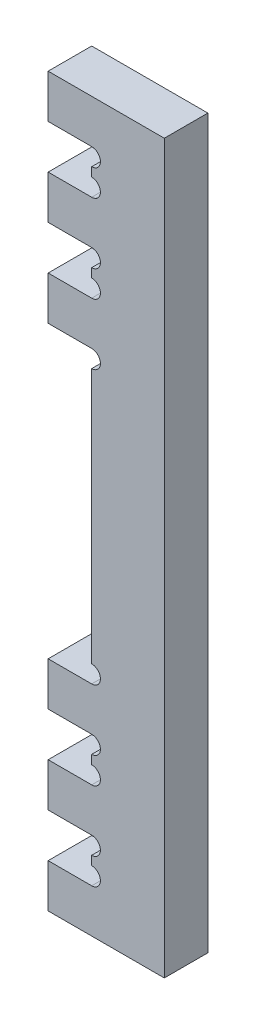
ISO-10303-21;
HEADER;
FILE_DESCRIPTION(('STEP AP214'),'2;1');
FILE_NAME('part.step','',(''),(''),'','','');
FILE_SCHEMA(('AUTOMOTIVE_DESIGN { 1 0 10303 214 1 1 1 1 }'));
ENDSEC;
DATA;
#1=APPLICATION_CONTEXT('core data for automotive mechanical design processes');
#2=APPLICATION_PROTOCOL_DEFINITION('international standard','automotive_design',2000,#1);
#3=PRODUCT_CONTEXT('',#1,'mechanical');
#4=PRODUCT('Part','Part','',(#3));
#5=PRODUCT_RELATED_PRODUCT_CATEGORY('part','',(#4));
#6=PRODUCT_DEFINITION_FORMATION('','',#4);
#7=PRODUCT_DEFINITION_CONTEXT('part definition',#1,'design');
#8=PRODUCT_DEFINITION('design','',#6,#7);
#9=PRODUCT_DEFINITION_SHAPE('','',#8);
#10=(LENGTH_UNIT() NAMED_UNIT(*) SI_UNIT(.MILLI.,.METRE.));
#11=(NAMED_UNIT(*) PLANE_ANGLE_UNIT() SI_UNIT($,.RADIAN.));
#12=(NAMED_UNIT(*) SI_UNIT($,.STERADIAN.) SOLID_ANGLE_UNIT());
#13=UNCERTAINTY_MEASURE_WITH_UNIT(LENGTH_MEASURE(1.E-05),#10,'distance_accuracy_value','');
#14=(GEOMETRIC_REPRESENTATION_CONTEXT(3) GLOBAL_UNCERTAINTY_ASSIGNED_CONTEXT((#13)) GLOBAL_UNIT_ASSIGNED_CONTEXT((#10,
#11,#12)) REPRESENTATION_CONTEXT('',''));
#15=CARTESIAN_POINT('',(0.,0.,0.));
#16=DIRECTION('',(0.,0.,1.));
#17=DIRECTION('',(1.,0.,0.));
#18=AXIS2_PLACEMENT_3D('',#15,#16,#17);
#19=CARTESIAN_POINT('',(15.,172.25,15.));
#20=DIRECTION('',(0.,0.,-1.));
#21=DIRECTION('',(-1.,0.,0.));
#22=AXIS2_PLACEMENT_3D('',#19,#20,#21);
#23=CYLINDRICAL_SURFACE('',#22,3.);
#24=CARTESIAN_POINT('',(15.,172.25,0.));
#25=DIRECTION('',(0.,0.,-1.));
#26=DIRECTION('',(-1.,0.,0.));
#27=AXIS2_PLACEMENT_3D('',#24,#25,#26);
#28=CIRCLE('',#27,3.);
#29=CARTESIAN_POINT('',(15.,175.25,0.));
#30=VERTEX_POINT('',#29);
#31=CARTESIAN_POINT('',(15.,169.25,0.));
#32=VERTEX_POINT('',#31);
#33=EDGE_CURVE('E336',#30,#32,#28,.T.);
#34=ORIENTED_EDGE('',*,*,#33,.T.);
#35=DIRECTION('',(0.,0.,-1.));
#36=VECTOR('',#35,1.);
#37=CARTESIAN_POINT('',(15.,169.25,15.));
#38=LINE('',#37,#36);
#39=CARTESIAN_POINT('',(15.,169.25,15.));
#40=VERTEX_POINT('',#39);
#41=EDGE_CURVE('E11',#40,#32,#38,.T.);
#42=ORIENTED_EDGE('',*,*,#41,.F.);
#43=CARTESIAN_POINT('',(15.,172.25,15.));
#44=DIRECTION('',(0.,0.,-1.));
#45=DIRECTION('',(-1.,0.,0.));
#46=AXIS2_PLACEMENT_3D('',#43,#44,#45);
#47=CIRCLE('',#46,3.);
#48=CARTESIAN_POINT('',(15.,175.25,15.));
#49=VERTEX_POINT('',#48);
#50=EDGE_CURVE('E446',#49,#40,#47,.T.);
#51=ORIENTED_EDGE('',*,*,#50,.F.);
#52=DIRECTION('',(0.,0.,-1.));
#53=VECTOR('',#52,1.);
#54=CARTESIAN_POINT('',(15.,175.25,15.));
#55=LINE('',#54,#53);
#56=EDGE_CURVE('E59',#49,#30,#55,.T.);
#57=ORIENTED_EDGE('',*,*,#56,.T.);
#58=EDGE_LOOP('',(#34,#42,#51,#57));
#59=FACE_BOUND('',#58,.T.);
#60=ADVANCED_FACE('F39',(#59),#23,.F.);
#61=CARTESIAN_POINT('',(15.,169.25,15.));
#62=DIRECTION('',(1.,0.,0.));
#63=DIRECTION('',(0.,1.,0.));
#64=AXIS2_PLACEMENT_3D('',#61,#62,#63);
#65=PLANE('',#64);
#66=DIRECTION('',(0.,-1.,0.));
#67=VECTOR('',#66,1.);
#68=CARTESIAN_POINT('',(15.,169.25,0.));
#69=LINE('',#68,#67);
#70=CARTESIAN_POINT('',(15.,81.2,0.));
#71=VERTEX_POINT('',#70);
#72=EDGE_CURVE('E339',#32,#71,#69,.T.);
#73=ORIENTED_EDGE('',*,*,#72,.T.);
#74=DIRECTION('',(0.,0.,-1.));
#75=VECTOR('',#74,1.);
#76=CARTESIAN_POINT('',(15.,81.2,15.));
#77=LINE('',#76,#75);
#78=CARTESIAN_POINT('',(15.,81.2,15.));
#79=VERTEX_POINT('',#78);
#80=EDGE_CURVE('E48',#79,#71,#77,.T.);
#81=ORIENTED_EDGE('',*,*,#80,.F.);
#82=DIRECTION('',(0.,-1.,0.));
#83=VECTOR('',#82,1.);
#84=CARTESIAN_POINT('',(15.,169.25,15.));
#85=LINE('',#84,#83);
#86=EDGE_CURVE('E195',#40,#79,#85,.T.);
#87=ORIENTED_EDGE('',*,*,#86,.F.);
#88=ORIENTED_EDGE('',*,*,#41,.T.);
#89=EDGE_LOOP('',(#73,#81,#87,#88));
#90=FACE_BOUND('',#89,.T.);
#91=ADVANCED_FACE('F657',(#90),#65,.F.);
#92=CARTESIAN_POINT('',(15.,78.2,15.));
#93=DIRECTION('',(0.,0.,-1.));
#94=DIRECTION('',(-1.,0.,0.));
#95=AXIS2_PLACEMENT_3D('',#92,#93,#94);
#96=CYLINDRICAL_SURFACE('',#95,3.);
#97=CARTESIAN_POINT('',(15.,78.2,0.));
#98=DIRECTION('',(0.,0.,-1.));
#99=DIRECTION('',(-1.,0.,0.));
#100=AXIS2_PLACEMENT_3D('',#97,#98,#99);
#101=CIRCLE('',#100,3.);
#102=CARTESIAN_POINT('',(15.,75.2,0.));
#103=VERTEX_POINT('',#102);
#104=EDGE_CURVE('E342',#71,#103,#101,.T.);
#105=ORIENTED_EDGE('',*,*,#104,.T.);
#106=DIRECTION('',(0.,0.,-1.));
#107=VECTOR('',#106,1.);
#108=CARTESIAN_POINT('',(15.,75.2,15.));
#109=LINE('',#108,#107);
#110=CARTESIAN_POINT('',(15.,75.2,15.));
#111=VERTEX_POINT('',#110);
#112=EDGE_CURVE('E529',#111,#103,#109,.T.);
#113=ORIENTED_EDGE('',*,*,#112,.F.);
#114=CARTESIAN_POINT('',(15.,78.2,15.));
#115=DIRECTION('',(0.,0.,-1.));
#116=DIRECTION('',(-1.,0.,0.));
#117=AXIS2_PLACEMENT_3D('',#114,#115,#116);
#118=CIRCLE('',#117,3.);
#119=EDGE_CURVE('E539',#79,#111,#118,.T.);
#120=ORIENTED_EDGE('',*,*,#119,.F.);
#121=ORIENTED_EDGE('',*,*,#80,.T.);
#122=EDGE_LOOP('',(#105,#113,#120,#121));
#123=FACE_BOUND('',#122,.T.);
#124=ADVANCED_FACE('F537',(#123),#96,.F.);
#125=CARTESIAN_POINT('',(0.,75.2,15.));
#126=DIRECTION('',(0.,1.,0.));
#127=DIRECTION('',(0.,0.,1.));
#128=AXIS2_PLACEMENT_3D('',#125,#126,#127);
#129=PLANE('',#128);
#130=DIRECTION('',(1.,0.,0.));
#131=VECTOR('',#130,1.);
#132=CARTESIAN_POINT('',(0.,75.2,0.));
#133=LINE('',#132,#131);
#134=CARTESIAN_POINT('',(0.,75.2,0.));
#135=VERTEX_POINT('',#134);
#136=EDGE_CURVE('E346',#135,#103,#133,.T.);
#137=ORIENTED_EDGE('',*,*,#136,.F.);
#138=DIRECTION('',(0.,0.,-1.));
#139=VECTOR('',#138,1.);
#140=CARTESIAN_POINT('',(0.,75.2,15.));
#141=LINE('',#140,#139);
#142=CARTESIAN_POINT('',(0.,75.2,15.));
#143=VERTEX_POINT('',#142);
#144=EDGE_CURVE('E526',#143,#135,#141,.T.);
#145=ORIENTED_EDGE('',*,*,#144,.F.);
#146=DIRECTION('',(1.,0.,0.));
#147=VECTOR('',#146,1.);
#148=CARTESIAN_POINT('',(0.,75.2,15.));
#149=LINE('',#148,#147);
#150=EDGE_CURVE('E548',#143,#111,#149,.T.);
#151=ORIENTED_EDGE('',*,*,#150,.T.);
#152=ORIENTED_EDGE('',*,*,#112,.T.);
#153=EDGE_LOOP('',(#137,#145,#151,#152));
#154=FACE_BOUND('',#153,.T.);
#155=ADVANCED_FACE('F545',(#154),#129,.T.);
#156=CARTESIAN_POINT('',(0.,60.2,15.));
#157=DIRECTION('',(-1.,0.,0.));
#158=DIRECTION('',(0.,0.,1.));
#159=AXIS2_PLACEMENT_3D('',#156,#157,#158);
#160=PLANE('',#159);
#161=DIRECTION('',(0.,1.,0.));
#162=VECTOR('',#161,1.);
#163=CARTESIAN_POINT('',(0.,60.2,0.));
#164=LINE('',#163,#162);
#165=CARTESIAN_POINT('',(0.,60.2,0.));
#166=VERTEX_POINT('',#165);
#167=EDGE_CURVE('E350',#166,#135,#164,.T.);
#168=ORIENTED_EDGE('',*,*,#167,.F.);
#169=DIRECTION('',(0.,0.,-1.));
#170=VECTOR('',#169,1.);
#171=CARTESIAN_POINT('',(0.,60.2,15.));
#172=LINE('',#171,#170);
#173=CARTESIAN_POINT('',(0.,60.2,15.));
#174=VERTEX_POINT('',#173);
#175=EDGE_CURVE('E523',#174,#166,#172,.T.);
#176=ORIENTED_EDGE('',*,*,#175,.F.);
#177=DIRECTION('',(0.,1.,0.));
#178=VECTOR('',#177,1.);
#179=CARTESIAN_POINT('',(0.,60.2,15.));
#180=LINE('',#179,#178);
#181=EDGE_CURVE('E552',#174,#143,#180,.T.);
#182=ORIENTED_EDGE('',*,*,#181,.T.);
#183=ORIENTED_EDGE('',*,*,#144,.T.);
#184=EDGE_LOOP('',(#168,#176,#182,#183));
#185=FACE_BOUND('',#184,.T.);
#186=ADVANCED_FACE('F672',(#185),#160,.T.);
#187=CARTESIAN_POINT('',(15.,60.2,15.));
#188=DIRECTION('',(0.,-1.,0.));
#189=DIRECTION('',(1.,0.,0.));
#190=AXIS2_PLACEMENT_3D('',#187,#188,#189);
#191=PLANE('',#190);
#192=DIRECTION('',(-1.,0.,0.));
#193=VECTOR('',#192,1.);
#194=CARTESIAN_POINT('',(15.,60.2,0.));
#195=LINE('',#194,#193);
#196=CARTESIAN_POINT('',(15.,60.2,0.));
#197=VERTEX_POINT('',#196);
#198=EDGE_CURVE('E354',#197,#166,#195,.T.);
#199=ORIENTED_EDGE('',*,*,#198,.F.);
#200=DIRECTION('',(0.,0.,-1.));
#201=VECTOR('',#200,1.);
#202=CARTESIAN_POINT('',(15.,60.2,15.));
#203=LINE('',#202,#201);
#204=CARTESIAN_POINT('',(15.,60.2,15.));
#205=VERTEX_POINT('',#204);
#206=EDGE_CURVE('E521',#205,#197,#203,.T.);
#207=ORIENTED_EDGE('',*,*,#206,.F.);
#208=DIRECTION('',(-1.,0.,0.));
#209=VECTOR('',#208,1.);
#210=CARTESIAN_POINT('',(15.,60.2,15.));
#211=LINE('',#210,#209);
#212=EDGE_CURVE('E555',#205,#174,#211,.T.);
#213=ORIENTED_EDGE('',*,*,#212,.T.);
#214=ORIENTED_EDGE('',*,*,#175,.T.);
#215=EDGE_LOOP('',(#199,#207,#213,#214));
#216=FACE_BOUND('',#215,.T.);
#217=ADVANCED_FACE('F675',(#216),#191,.T.);
#218=CARTESIAN_POINT('',(15.,57.2,15.));
#219=DIRECTION('',(0.,0.,-1.));
#220=DIRECTION('',(-1.,0.,0.));
#221=AXIS2_PLACEMENT_3D('',#218,#219,#220);
#222=CYLINDRICAL_SURFACE('',#221,3.);
#223=CARTESIAN_POINT('',(15.,57.2,0.));
#224=DIRECTION('',(0.,0.,-1.));
#225=DIRECTION('',(-1.,0.,0.));
#226=AXIS2_PLACEMENT_3D('',#223,#224,#225);
#227=CIRCLE('',#226,3.);
#228=CARTESIAN_POINT('',(15.,54.2,0.));
#229=VERTEX_POINT('',#228);
#230=EDGE_CURVE('E357',#197,#229,#227,.T.);
#231=ORIENTED_EDGE('',*,*,#230,.T.);
#232=DIRECTION('',(0.,0.,-1.));
#233=VECTOR('',#232,1.);
#234=CARTESIAN_POINT('',(15.,54.2,15.));
#235=LINE('',#234,#233);
#236=CARTESIAN_POINT('',(15.,54.2,15.));
#237=VERTEX_POINT('',#236);
#238=EDGE_CURVE('E518',#237,#229,#235,.T.);
#239=ORIENTED_EDGE('',*,*,#238,.F.);
#240=CARTESIAN_POINT('',(15.,57.2,15.));
#241=DIRECTION('',(0.,0.,-1.));
#242=DIRECTION('',(-1.,0.,0.));
#243=AXIS2_PLACEMENT_3D('',#240,#241,#242);
#244=CIRCLE('',#243,3.);
#245=EDGE_CURVE('E563',#205,#237,#244,.T.);
#246=ORIENTED_EDGE('',*,*,#245,.F.);
#247=ORIENTED_EDGE('',*,*,#206,.T.);
#248=EDGE_LOOP('',(#231,#239,#246,#247));
#249=FACE_BOUND('',#248,.T.);
#250=ADVANCED_FACE('F679',(#249),#222,.F.);
#251=CARTESIAN_POINT('',(15.,54.2,15.));
#252=DIRECTION('',(1.,0.,0.));
#253=DIRECTION('',(0.,0.,-1.));
#254=AXIS2_PLACEMENT_3D('',#251,#252,#253);
#255=PLANE('',#254);
#256=DIRECTION('',(0.,-1.,0.));
#257=VECTOR('',#256,1.);
#258=CARTESIAN_POINT('',(15.,54.2,0.));
#259=LINE('',#258,#257);
#260=CARTESIAN_POINT('',(15.,51.1,0.));
#261=VERTEX_POINT('',#260);
#262=EDGE_CURVE('E359',#229,#261,#259,.T.);
#263=ORIENTED_EDGE('',*,*,#262,.T.);
#264=DIRECTION('',(0.,0.,-1.));
#265=VECTOR('',#264,1.);
#266=CARTESIAN_POINT('',(15.,51.1,15.));
#267=LINE('',#266,#265);
#268=CARTESIAN_POINT('',(15.,51.1,15.));
#269=VERTEX_POINT('',#268);
#270=EDGE_CURVE('E515',#269,#261,#267,.T.);
#271=ORIENTED_EDGE('',*,*,#270,.F.);
#272=DIRECTION('',(0.,-1.,0.));
#273=VECTOR('',#272,1.);
#274=CARTESIAN_POINT('',(15.,54.2,15.));
#275=LINE('',#274,#273);
#276=EDGE_CURVE('E565',#237,#269,#275,.T.);
#277=ORIENTED_EDGE('',*,*,#276,.F.);
#278=ORIENTED_EDGE('',*,*,#238,.T.);
#279=EDGE_LOOP('',(#263,#271,#277,#278));
#280=FACE_BOUND('',#279,.T.);
#281=ADVANCED_FACE('F683',(#280),#255,.F.);
#282=CARTESIAN_POINT('',(15.,48.1,15.));
#283=DIRECTION('',(0.,0.,-1.));
#284=DIRECTION('',(-1.,0.,0.));
#285=AXIS2_PLACEMENT_3D('',#282,#283,#284);
#286=CYLINDRICAL_SURFACE('',#285,3.);
#287=CARTESIAN_POINT('',(15.,48.1,0.));
#288=DIRECTION('',(0.,0.,-1.));
#289=DIRECTION('',(-1.,0.,0.));
#290=AXIS2_PLACEMENT_3D('',#287,#288,#289);
#291=CIRCLE('',#290,3.);
#292=CARTESIAN_POINT('',(15.,45.1,0.));
#293=VERTEX_POINT('',#292);
#294=EDGE_CURVE('E361',#261,#293,#291,.T.);
#295=ORIENTED_EDGE('',*,*,#294,.T.);
#296=DIRECTION('',(0.,0.,-1.));
#297=VECTOR('',#296,1.);
#298=CARTESIAN_POINT('',(15.,45.1,15.));
#299=LINE('',#298,#297);
#300=CARTESIAN_POINT('',(15.,45.1,15.));
#301=VERTEX_POINT('',#300);
#302=EDGE_CURVE('E513',#301,#293,#299,.T.);
#303=ORIENTED_EDGE('',*,*,#302,.F.);
#304=CARTESIAN_POINT('',(15.,48.1,15.));
#305=DIRECTION('',(0.,0.,-1.));
#306=DIRECTION('',(-1.,0.,0.));
#307=AXIS2_PLACEMENT_3D('',#304,#305,#306);
#308=CIRCLE('',#307,3.);
#309=EDGE_CURVE('E567',#269,#301,#308,.T.);
#310=ORIENTED_EDGE('',*,*,#309,.F.);
#311=ORIENTED_EDGE('',*,*,#270,.T.);
#312=EDGE_LOOP('',(#295,#303,#310,#311));
#313=FACE_BOUND('',#312,.T.);
#314=ADVANCED_FACE('F687',(#313),#286,.F.);
#315=CARTESIAN_POINT('',(0.,45.1,15.));
#316=DIRECTION('',(0.,1.,0.));
#317=DIRECTION('',(-1.,0.,0.));
#318=AXIS2_PLACEMENT_3D('',#315,#316,#317);
#319=PLANE('',#318);
#320=DIRECTION('',(1.,0.,0.));
#321=VECTOR('',#320,1.);
#322=CARTESIAN_POINT('',(0.,45.1,0.));
#323=LINE('',#322,#321);
#324=CARTESIAN_POINT('',(0.,45.1,0.));
#325=VERTEX_POINT('',#324);
#326=EDGE_CURVE('E364',#325,#293,#323,.T.);
#327=ORIENTED_EDGE('',*,*,#326,.F.);
#328=DIRECTION('',(0.,0.,-1.));
#329=VECTOR('',#328,1.);
#330=CARTESIAN_POINT('',(0.,45.1,15.));
#331=LINE('',#330,#329);
#332=CARTESIAN_POINT('',(0.,45.1,15.));
#333=VERTEX_POINT('',#332);
#334=EDGE_CURVE('E511',#333,#325,#331,.T.);
#335=ORIENTED_EDGE('',*,*,#334,.F.);
#336=DIRECTION('',(1.,0.,0.));
#337=VECTOR('',#336,1.);
#338=CARTESIAN_POINT('',(0.,45.1,15.));
#339=LINE('',#338,#337);
#340=EDGE_CURVE('E569',#333,#301,#339,.T.);
#341=ORIENTED_EDGE('',*,*,#340,.T.);
#342=ORIENTED_EDGE('',*,*,#302,.T.);
#343=EDGE_LOOP('',(#327,#335,#341,#342));
#344=FACE_BOUND('',#343,.T.);
#345=ADVANCED_FACE('F691',(#344),#319,.T.);
#346=CARTESIAN_POINT('',(0.,30.1,15.));
#347=DIRECTION('',(-1.,0.,0.));
#348=DIRECTION('',(0.,0.,1.));
#349=AXIS2_PLACEMENT_3D('',#346,#347,#348);
#350=PLANE('',#349);
#351=DIRECTION('',(0.,1.,0.));
#352=VECTOR('',#351,1.);
#353=CARTESIAN_POINT('',(0.,30.1,0.));
#354=LINE('',#353,#352);
#355=CARTESIAN_POINT('',(0.,30.1,0.));
#356=VERTEX_POINT('',#355);
#357=EDGE_CURVE('E367',#356,#325,#354,.T.);
#358=ORIENTED_EDGE('',*,*,#357,.F.);
#359=DIRECTION('',(0.,0.,-1.));
#360=VECTOR('',#359,1.);
#361=CARTESIAN_POINT('',(0.,30.1,15.));
#362=LINE('',#361,#360);
#363=CARTESIAN_POINT('',(0.,30.1,15.));
#364=VERTEX_POINT('',#363);
#365=EDGE_CURVE('E509',#364,#356,#362,.T.);
#366=ORIENTED_EDGE('',*,*,#365,.F.);
#367=DIRECTION('',(0.,1.,0.));
#368=VECTOR('',#367,1.);
#369=CARTESIAN_POINT('',(0.,30.1,15.));
#370=LINE('',#369,#368);
#371=EDGE_CURVE('E572',#364,#333,#370,.T.);
#372=ORIENTED_EDGE('',*,*,#371,.T.);
#373=ORIENTED_EDGE('',*,*,#334,.T.);
#374=EDGE_LOOP('',(#358,#366,#372,#373));
#375=FACE_BOUND('',#374,.T.);
#376=ADVANCED_FACE('F695',(#375),#350,.T.);
#377=CARTESIAN_POINT('',(15.,30.1,15.));
#378=DIRECTION('',(0.,-1.,0.));
#379=DIRECTION('',(1.,0.,0.));
#380=AXIS2_PLACEMENT_3D('',#377,#378,#379);
#381=PLANE('',#380);
#382=DIRECTION('',(-1.,0.,0.));
#383=VECTOR('',#382,1.);
#384=CARTESIAN_POINT('',(15.,30.1,0.));
#385=LINE('',#384,#383);
#386=CARTESIAN_POINT('',(15.,30.1,0.));
#387=VERTEX_POINT('',#386);
#388=EDGE_CURVE('E370',#387,#356,#385,.T.);
#389=ORIENTED_EDGE('',*,*,#388,.F.);
#390=DIRECTION('',(0.,0.,-1.));
#391=VECTOR('',#390,1.);
#392=CARTESIAN_POINT('',(15.,30.1,15.));
#393=LINE('',#392,#391);
#394=CARTESIAN_POINT('',(15.,30.1,15.));
#395=VERTEX_POINT('',#394);
#396=EDGE_CURVE('E507',#395,#387,#393,.T.);
#397=ORIENTED_EDGE('',*,*,#396,.F.);
#398=DIRECTION('',(-1.,0.,0.));
#399=VECTOR('',#398,1.);
#400=CARTESIAN_POINT('',(15.,30.1,15.));
#401=LINE('',#400,#399);
#402=EDGE_CURVE('E575',#395,#364,#401,.T.);
#403=ORIENTED_EDGE('',*,*,#402,.T.);
#404=ORIENTED_EDGE('',*,*,#365,.T.);
#405=EDGE_LOOP('',(#389,#397,#403,#404));
#406=FACE_BOUND('',#405,.T.);
#407=ADVANCED_FACE('F699',(#406),#381,.T.);
#408=CARTESIAN_POINT('',(15.,27.1,15.));
#409=DIRECTION('',(0.,0.,-1.));
#410=DIRECTION('',(-1.,0.,0.));
#411=AXIS2_PLACEMENT_3D('',#408,#409,#410);
#412=CYLINDRICAL_SURFACE('',#411,3.00000000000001);
#413=CARTESIAN_POINT('',(15.,27.1,0.));
#414=DIRECTION('',(0.,0.,-1.));
#415=DIRECTION('',(-1.,0.,0.));
#416=AXIS2_PLACEMENT_3D('',#413,#414,#415);
#417=CIRCLE('',#416,3.00000000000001);
#418=CARTESIAN_POINT('',(15.,24.1,0.));
#419=VERTEX_POINT('',#418);
#420=EDGE_CURVE('E373',#387,#419,#417,.T.);
#421=ORIENTED_EDGE('',*,*,#420,.T.);
#422=DIRECTION('',(0.,0.,-1.));
#423=VECTOR('',#422,1.);
#424=CARTESIAN_POINT('',(15.,24.1,15.));
#425=LINE('',#424,#423);
#426=CARTESIAN_POINT('',(15.,24.1,15.));
#427=VERTEX_POINT('',#426);
#428=EDGE_CURVE('E504',#427,#419,#425,.T.);
#429=ORIENTED_EDGE('',*,*,#428,.F.);
#430=CARTESIAN_POINT('',(15.,27.1,15.));
#431=DIRECTION('',(0.,0.,-1.));
#432=DIRECTION('',(-1.,0.,0.));
#433=AXIS2_PLACEMENT_3D('',#430,#431,#432);
#434=CIRCLE('',#433,3.00000000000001);
#435=EDGE_CURVE('E578',#395,#427,#434,.T.);
#436=ORIENTED_EDGE('',*,*,#435,.F.);
#437=ORIENTED_EDGE('',*,*,#396,.T.);
#438=EDGE_LOOP('',(#421,#429,#436,#437));
#439=FACE_BOUND('',#438,.T.);
#440=ADVANCED_FACE('F703',(#439),#412,.F.);
#441=CARTESIAN_POINT('',(15.,24.1,15.));
#442=DIRECTION('',(1.,0.,0.));
#443=DIRECTION('',(0.,1.,0.));
#444=AXIS2_PLACEMENT_3D('',#441,#442,#443);
#445=PLANE('',#444);
#446=DIRECTION('',(0.,-1.,0.));
#447=VECTOR('',#446,1.);
#448=CARTESIAN_POINT('',(15.,24.1,0.));
#449=LINE('',#448,#447);
#450=CARTESIAN_POINT('',(15.,21.,0.));
#451=VERTEX_POINT('',#450);
#452=EDGE_CURVE('E375',#419,#451,#449,.T.);
#453=ORIENTED_EDGE('',*,*,#452,.T.);
#454=DIRECTION('',(0.,0.,-1.));
#455=VECTOR('',#454,1.);
#456=CARTESIAN_POINT('',(15.,21.,15.));
#457=LINE('',#456,#455);
#458=CARTESIAN_POINT('',(15.,21.,15.));
#459=VERTEX_POINT('',#458);
#460=EDGE_CURVE('E501',#459,#451,#457,.T.);
#461=ORIENTED_EDGE('',*,*,#460,.F.);
#462=DIRECTION('',(0.,-1.,0.));
#463=VECTOR('',#462,1.);
#464=CARTESIAN_POINT('',(15.,24.1,15.));
#465=LINE('',#464,#463);
#466=EDGE_CURVE('E580',#427,#459,#465,.T.);
#467=ORIENTED_EDGE('',*,*,#466,.F.);
#468=ORIENTED_EDGE('',*,*,#428,.T.);
#469=EDGE_LOOP('',(#453,#461,#467,#468));
#470=FACE_BOUND('',#469,.T.);
#471=ADVANCED_FACE('F707',(#470),#445,.F.);
#472=CARTESIAN_POINT('',(15.,18.,15.));
#473=DIRECTION('',(0.,0.,-1.));
#474=DIRECTION('',(-1.,0.,0.));
#475=AXIS2_PLACEMENT_3D('',#472,#473,#474);
#476=CYLINDRICAL_SURFACE('',#475,2.99999999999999);
#477=CARTESIAN_POINT('',(15.,18.,0.));
#478=DIRECTION('',(0.,0.,-1.));
#479=DIRECTION('',(-1.,0.,0.));
#480=AXIS2_PLACEMENT_3D('',#477,#478,#479);
#481=CIRCLE('',#480,2.99999999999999);
#482=CARTESIAN_POINT('',(15.,15.,0.));
#483=VERTEX_POINT('',#482);
#484=EDGE_CURVE('E377',#451,#483,#481,.T.);
#485=ORIENTED_EDGE('',*,*,#484,.T.);
#486=DIRECTION('',(0.,0.,-1.));
#487=VECTOR('',#486,1.);
#488=CARTESIAN_POINT('',(15.,15.,15.));
#489=LINE('',#488,#487);
#490=CARTESIAN_POINT('',(15.,15.,15.));
#491=VERTEX_POINT('',#490);
#492=EDGE_CURVE('E499',#491,#483,#489,.T.);
#493=ORIENTED_EDGE('',*,*,#492,.F.);
#494=CARTESIAN_POINT('',(15.,18.,15.));
#495=DIRECTION('',(0.,0.,-1.));
#496=DIRECTION('',(-1.,0.,0.));
#497=AXIS2_PLACEMENT_3D('',#494,#495,#496);
#498=CIRCLE('',#497,2.99999999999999);
#499=EDGE_CURVE('E582',#459,#491,#498,.T.);
#500=ORIENTED_EDGE('',*,*,#499,.F.);
#501=ORIENTED_EDGE('',*,*,#460,.T.);
#502=EDGE_LOOP('',(#485,#493,#500,#501));
#503=FACE_BOUND('',#502,.T.);
#504=ADVANCED_FACE('F711',(#503),#476,.F.);
#505=CARTESIAN_POINT('',(0.,15.,15.));
#506=DIRECTION('',(0.,1.,0.));
#507=DIRECTION('',(-1.,0.,0.));
#508=AXIS2_PLACEMENT_3D('',#505,#506,#507);
#509=PLANE('',#508);
#510=DIRECTION('',(1.,0.,0.));
#511=VECTOR('',#510,1.);
#512=CARTESIAN_POINT('',(0.,15.,0.));
#513=LINE('',#512,#511);
#514=CARTESIAN_POINT('',(0.,15.,0.));
#515=VERTEX_POINT('',#514);
#516=EDGE_CURVE('E380',#515,#483,#513,.T.);
#517=ORIENTED_EDGE('',*,*,#516,.F.);
#518=DIRECTION('',(0.,0.,-1.));
#519=VECTOR('',#518,1.);
#520=CARTESIAN_POINT('',(0.,15.,15.));
#521=LINE('',#520,#519);
#522=CARTESIAN_POINT('',(0.,15.,15.));
#523=VERTEX_POINT('',#522);
#524=EDGE_CURVE('E497',#523,#515,#521,.T.);
#525=ORIENTED_EDGE('',*,*,#524,.F.);
#526=DIRECTION('',(1.,0.,0.));
#527=VECTOR('',#526,1.);
#528=CARTESIAN_POINT('',(0.,15.,15.));
#529=LINE('',#528,#527);
#530=EDGE_CURVE('E584',#523,#491,#529,.T.);
#531=ORIENTED_EDGE('',*,*,#530,.T.);
#532=ORIENTED_EDGE('',*,*,#492,.T.);
#533=EDGE_LOOP('',(#517,#525,#531,#532));
#534=FACE_BOUND('',#533,.T.);
#535=ADVANCED_FACE('F715',(#534),#509,.T.);
#536=CARTESIAN_POINT('',(0.,0.,15.));
#537=DIRECTION('',(-1.,0.,0.));
#538=DIRECTION('',(0.,0.,1.));
#539=AXIS2_PLACEMENT_3D('',#536,#537,#538);
#540=PLANE('',#539);
#541=DIRECTION('',(0.,1.,0.));
#542=VECTOR('',#541,1.);
#543=CARTESIAN_POINT('',(0.,0.,0.));
#544=LINE('',#543,#542);
#545=CARTESIAN_POINT('',(0.,0.,0.));
#546=VERTEX_POINT('',#545);
#547=EDGE_CURVE('E383',#546,#515,#544,.T.);
#548=ORIENTED_EDGE('',*,*,#547,.F.);
#549=DIRECTION('',(0.,0.,-1.));
#550=VECTOR('',#549,1.);
#551=CARTESIAN_POINT('',(0.,0.,15.));
#552=LINE('',#551,#550);
#553=CARTESIAN_POINT('',(0.,0.,15.));
#554=VERTEX_POINT('',#553);
#555=EDGE_CURVE('E495',#554,#546,#552,.T.);
#556=ORIENTED_EDGE('',*,*,#555,.F.);
#557=DIRECTION('',(0.,1.,0.));
#558=VECTOR('',#557,1.);
#559=CARTESIAN_POINT('',(0.,0.,15.));
#560=LINE('',#559,#558);
#561=EDGE_CURVE('E587',#554,#523,#560,.T.);
#562=ORIENTED_EDGE('',*,*,#561,.T.);
#563=ORIENTED_EDGE('',*,*,#524,.T.);
#564=EDGE_LOOP('',(#548,#556,#562,#563));
#565=FACE_BOUND('',#564,.T.);
#566=ADVANCED_FACE('F719',(#565),#540,.T.);
#567=CARTESIAN_POINT('',(0.,0.,15.));
#568=DIRECTION('',(0.,1.,0.));
#569=DIRECTION('',(0.,0.,1.));
#570=AXIS2_PLACEMENT_3D('',#567,#568,#569);
#571=PLANE('',#570);
#572=DIRECTION('',(1.,0.,0.));
#573=VECTOR('',#572,1.);
#574=CARTESIAN_POINT('',(0.,0.,0.));
#575=LINE('',#574,#573);
#576=CARTESIAN_POINT('',(40.,0.,0.));
#577=VERTEX_POINT('',#576);
#578=EDGE_CURVE('E386',#546,#577,#575,.T.);
#579=ORIENTED_EDGE('',*,*,#578,.T.);
#580=DIRECTION('',(0.,0.,-1.));
#581=VECTOR('',#580,1.);
#582=CARTESIAN_POINT('',(40.,0.,15.));
#583=LINE('',#582,#581);
#584=CARTESIAN_POINT('',(40.,0.,15.));
#585=VERTEX_POINT('',#584);
#586=EDGE_CURVE('E493',#585,#577,#583,.T.);
#587=ORIENTED_EDGE('',*,*,#586,.F.);
#588=DIRECTION('',(1.,0.,0.));
#589=VECTOR('',#588,1.);
#590=CARTESIAN_POINT('',(0.,0.,15.));
#591=LINE('',#590,#589);
#592=EDGE_CURVE('E590',#554,#585,#591,.T.);
#593=ORIENTED_EDGE('',*,*,#592,.F.);
#594=ORIENTED_EDGE('',*,*,#555,.T.);
#595=EDGE_LOOP('',(#579,#587,#593,#594));
#596=FACE_BOUND('',#595,.T.);
#597=ADVANCED_FACE('F723',(#596),#571,.F.);
#598=CARTESIAN_POINT('',(40.,250.45,15.));
#599=DIRECTION('',(1.,0.,0.));
#600=DIRECTION('',(0.,1.,0.));
#601=AXIS2_PLACEMENT_3D('',#598,#599,#600);
#602=PLANE('',#601);
#603=DIRECTION('',(0.,-1.,0.));
#604=VECTOR('',#603,1.);
#605=CARTESIAN_POINT('',(40.,250.45,0.));
#606=LINE('',#605,#604);
#607=CARTESIAN_POINT('',(40.,250.45,0.));
#608=VERTEX_POINT('',#607);
#609=EDGE_CURVE('E389',#608,#577,#606,.T.);
#610=ORIENTED_EDGE('',*,*,#609,.F.);
#611=DIRECTION('',(0.,0.,-1.));
#612=VECTOR('',#611,1.);
#613=CARTESIAN_POINT('',(40.,250.45,15.));
#614=LINE('',#613,#612);
#615=CARTESIAN_POINT('',(40.,250.45,15.));
#616=VERTEX_POINT('',#615);
#617=EDGE_CURVE('E490',#616,#608,#614,.T.);
#618=ORIENTED_EDGE('',*,*,#617,.F.);
#619=DIRECTION('',(0.,-1.,0.));
#620=VECTOR('',#619,1.);
#621=CARTESIAN_POINT('',(40.,250.45,15.));
#622=LINE('',#621,#620);
#623=EDGE_CURVE('E592',#616,#585,#622,.T.);
#624=ORIENTED_EDGE('',*,*,#623,.T.);
#625=ORIENTED_EDGE('',*,*,#586,.T.);
#626=EDGE_LOOP('',(#610,#618,#624,#625));
#627=FACE_BOUND('',#626,.T.);
#628=ADVANCED_FACE('F727',(#627),#602,.T.);
#629=CARTESIAN_POINT('',(0.,250.45,15.));
#630=DIRECTION('',(0.,1.,0.));
#631=DIRECTION('',(0.,0.,1.));
#632=AXIS2_PLACEMENT_3D('',#629,#630,#631);
#633=PLANE('',#632);
#634=DIRECTION('',(1.,0.,0.));
#635=VECTOR('',#634,1.);
#636=CARTESIAN_POINT('',(0.,250.45,0.));
#637=LINE('',#636,#635);
#638=CARTESIAN_POINT('',(0.,250.45,0.));
#639=VERTEX_POINT('',#638);
#640=EDGE_CURVE('E393',#639,#608,#637,.T.);
#641=ORIENTED_EDGE('',*,*,#640,.F.);
#642=DIRECTION('',(0.,0.,-1.));
#643=VECTOR('',#642,1.);
#644=CARTESIAN_POINT('',(0.,250.45,15.));
#645=LINE('',#644,#643);
#646=CARTESIAN_POINT('',(0.,250.45,15.));
#647=VERTEX_POINT('',#646);
#648=EDGE_CURVE('E487',#647,#639,#645,.T.);
#649=ORIENTED_EDGE('',*,*,#648,.F.);
#650=DIRECTION('',(1.,0.,0.));
#651=VECTOR('',#650,1.);
#652=CARTESIAN_POINT('',(0.,250.45,15.));
#653=LINE('',#652,#651);
#654=EDGE_CURVE('E596',#647,#616,#653,.T.);
#655=ORIENTED_EDGE('',*,*,#654,.T.);
#656=ORIENTED_EDGE('',*,*,#617,.T.);
#657=EDGE_LOOP('',(#641,#649,#655,#656));
#658=FACE_BOUND('',#657,.T.);
#659=ADVANCED_FACE('F731',(#658),#633,.T.);
#660=CARTESIAN_POINT('',(0.,235.45,15.));
#661=DIRECTION('',(-1.,0.,0.));
#662=DIRECTION('',(0.,0.,1.));
#663=AXIS2_PLACEMENT_3D('',#660,#661,#662);
#664=PLANE('',#663);
#665=DIRECTION('',(0.,1.,0.));
#666=VECTOR('',#665,1.);
#667=CARTESIAN_POINT('',(0.,235.45,0.));
#668=LINE('',#667,#666);
#669=CARTESIAN_POINT('',(0.,235.45,0.));
#670=VERTEX_POINT('',#669);
#671=EDGE_CURVE('E397',#670,#639,#668,.T.);
#672=ORIENTED_EDGE('',*,*,#671,.F.);
#673=DIRECTION('',(0.,0.,-1.));
#674=VECTOR('',#673,1.);
#675=CARTESIAN_POINT('',(0.,235.45,15.));
#676=LINE('',#675,#674);
#677=CARTESIAN_POINT('',(0.,235.45,15.));
#678=VERTEX_POINT('',#677);
#679=EDGE_CURVE('E484',#678,#670,#676,.T.);
#680=ORIENTED_EDGE('',*,*,#679,.F.);
#681=DIRECTION('',(0.,1.,0.));
#682=VECTOR('',#681,1.);
#683=CARTESIAN_POINT('',(0.,235.45,15.));
#684=LINE('',#683,#682);
#685=EDGE_CURVE('E600',#678,#647,#684,.T.);
#686=ORIENTED_EDGE('',*,*,#685,.T.);
#687=ORIENTED_EDGE('',*,*,#648,.T.);
#688=EDGE_LOOP('',(#672,#680,#686,#687));
#689=FACE_BOUND('',#688,.T.);
#690=ADVANCED_FACE('F735',(#689),#664,.T.);
#691=CARTESIAN_POINT('',(15.,235.45,15.));
#692=DIRECTION('',(0.,-1.,0.));
#693=DIRECTION('',(0.,0.,-1.));
#694=AXIS2_PLACEMENT_3D('',#691,#692,#693);
#695=PLANE('',#694);
#696=DIRECTION('',(-1.,0.,0.));
#697=VECTOR('',#696,1.);
#698=CARTESIAN_POINT('',(15.,235.45,0.));
#699=LINE('',#698,#697);
#700=CARTESIAN_POINT('',(15.,235.45,0.));
#701=VERTEX_POINT('',#700);
#702=EDGE_CURVE('E401',#701,#670,#699,.T.);
#703=ORIENTED_EDGE('',*,*,#702,.F.);
#704=DIRECTION('',(0.,0.,-1.));
#705=VECTOR('',#704,1.);
#706=CARTESIAN_POINT('',(15.,235.45,15.));
#707=LINE('',#706,#705);
#708=CARTESIAN_POINT('',(15.,235.45,15.));
#709=VERTEX_POINT('',#708);
#710=EDGE_CURVE('E481',#709,#701,#707,.T.);
#711=ORIENTED_EDGE('',*,*,#710,.F.);
#712=DIRECTION('',(-1.,0.,0.));
#713=VECTOR('',#712,1.);
#714=CARTESIAN_POINT('',(15.,235.45,15.));
#715=LINE('',#714,#713);
#716=EDGE_CURVE('E604',#709,#678,#715,.T.);
#717=ORIENTED_EDGE('',*,*,#716,.T.);
#718=ORIENTED_EDGE('',*,*,#679,.T.);
#719=EDGE_LOOP('',(#703,#711,#717,#718));
#720=FACE_BOUND('',#719,.T.);
#721=ADVANCED_FACE('F739',(#720),#695,.T.);
#722=CARTESIAN_POINT('',(15.,232.45,15.));
#723=DIRECTION('',(0.,0.,-1.));
#724=DIRECTION('',(-1.,0.,0.));
#725=AXIS2_PLACEMENT_3D('',#722,#723,#724);
#726=CYLINDRICAL_SURFACE('',#725,3.);
#727=CARTESIAN_POINT('',(15.,232.45,0.));
#728=DIRECTION('',(0.,0.,-1.));
#729=DIRECTION('',(-1.,0.,0.));
#730=AXIS2_PLACEMENT_3D('',#727,#728,#729);
#731=CIRCLE('',#730,3.);
#732=CARTESIAN_POINT('',(15.,229.45,0.));
#733=VERTEX_POINT('',#732);
#734=EDGE_CURVE('E405',#701,#733,#731,.T.);
#735=ORIENTED_EDGE('',*,*,#734,.T.);
#736=DIRECTION('',(0.,0.,-1.));
#737=VECTOR('',#736,1.);
#738=CARTESIAN_POINT('',(15.,229.45,15.));
#739=LINE('',#738,#737);
#740=CARTESIAN_POINT('',(15.,229.45,15.));
#741=VERTEX_POINT('',#740);
#742=EDGE_CURVE('E477',#741,#733,#739,.T.);
#743=ORIENTED_EDGE('',*,*,#742,.F.);
#744=CARTESIAN_POINT('',(15.,232.45,15.));
#745=DIRECTION('',(0.,0.,-1.));
#746=DIRECTION('',(-1.,0.,0.));
#747=AXIS2_PLACEMENT_3D('',#744,#745,#746);
#748=CIRCLE('',#747,3.);
#749=EDGE_CURVE('E608',#709,#741,#748,.T.);
#750=ORIENTED_EDGE('',*,*,#749,.F.);
#751=ORIENTED_EDGE('',*,*,#710,.T.);
#752=EDGE_LOOP('',(#735,#743,#750,#751));
#753=FACE_BOUND('',#752,.T.);
#754=ADVANCED_FACE('F743',(#753),#726,.F.);
#755=CARTESIAN_POINT('',(15.,229.45,15.));
#756=DIRECTION('',(1.,0.,0.));
#757=DIRECTION('',(0.,0.,-1.));
#758=AXIS2_PLACEMENT_3D('',#755,#756,#757);
#759=PLANE('',#758);
#760=DIRECTION('',(0.,-1.,0.));
#761=VECTOR('',#760,1.);
#762=CARTESIAN_POINT('',(15.,229.45,0.));
#763=LINE('',#762,#761);
#764=CARTESIAN_POINT('',(15.,226.35,0.));
#765=VERTEX_POINT('',#764);
#766=EDGE_CURVE('E408',#733,#765,#763,.T.);
#767=ORIENTED_EDGE('',*,*,#766,.T.);
#768=DIRECTION('',(0.,0.,-1.));
#769=VECTOR('',#768,1.);
#770=CARTESIAN_POINT('',(15.,226.35,15.));
#771=LINE('',#770,#769);
#772=CARTESIAN_POINT('',(15.,226.35,15.));
#773=VERTEX_POINT('',#772);
#774=EDGE_CURVE('E473',#773,#765,#771,.T.);
#775=ORIENTED_EDGE('',*,*,#774,.F.);
#776=DIRECTION('',(0.,-1.,0.));
#777=VECTOR('',#776,1.);
#778=CARTESIAN_POINT('',(15.,229.45,15.));
#779=LINE('',#778,#777);
#780=EDGE_CURVE('E611',#741,#773,#779,.T.);
#781=ORIENTED_EDGE('',*,*,#780,.F.);
#782=ORIENTED_EDGE('',*,*,#742,.T.);
#783=EDGE_LOOP('',(#767,#775,#781,#782));
#784=FACE_BOUND('',#783,.T.);
#785=ADVANCED_FACE('F747',(#784),#759,.F.);
#786=CARTESIAN_POINT('',(15.0000000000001,223.35,15.));
#787=DIRECTION('',(0.,0.,-1.));
#788=DIRECTION('',(-1.,0.,0.));
#789=AXIS2_PLACEMENT_3D('',#786,#787,#788);
#790=CYLINDRICAL_SURFACE('',#789,3.);
#791=CARTESIAN_POINT('',(15.0000000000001,223.35,0.));
#792=DIRECTION('',(0.,0.,-1.));
#793=DIRECTION('',(-1.,0.,0.));
#794=AXIS2_PLACEMENT_3D('',#791,#792,#793);
#795=CIRCLE('',#794,3.);
#796=CARTESIAN_POINT('',(15.,220.35,0.));
#797=VERTEX_POINT('',#796);
#798=EDGE_CURVE('E411',#765,#797,#795,.T.);
#799=ORIENTED_EDGE('',*,*,#798,.T.);
#800=DIRECTION('',(0.,0.,-1.));
#801=VECTOR('',#800,1.);
#802=CARTESIAN_POINT('',(15.,220.35,15.));
#803=LINE('',#802,#801);
#804=CARTESIAN_POINT('',(15.,220.35,15.));
#805=VERTEX_POINT('',#804);
#806=EDGE_CURVE('E470',#805,#797,#803,.T.);
#807=ORIENTED_EDGE('',*,*,#806,.F.);
#808=CARTESIAN_POINT('',(15.0000000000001,223.35,15.));
#809=DIRECTION('',(0.,0.,-1.));
#810=DIRECTION('',(-1.,0.,0.));
#811=AXIS2_PLACEMENT_3D('',#808,#809,#810);
#812=CIRCLE('',#811,3.);
#813=EDGE_CURVE('E614',#773,#805,#812,.T.);
#814=ORIENTED_EDGE('',*,*,#813,.F.);
#815=ORIENTED_EDGE('',*,*,#774,.T.);
#816=EDGE_LOOP('',(#799,#807,#814,#815));
#817=FACE_BOUND('',#816,.T.);
#818=ADVANCED_FACE('F751',(#817),#790,.F.);
#819=CARTESIAN_POINT('',(0.,220.35,15.));
#820=DIRECTION('',(0.,1.,0.));
#821=DIRECTION('',(0.,0.,1.));
#822=AXIS2_PLACEMENT_3D('',#819,#820,#821);
#823=PLANE('',#822);
#824=DIRECTION('',(1.,0.,0.));
#825=VECTOR('',#824,1.);
#826=CARTESIAN_POINT('',(0.,220.35,0.));
#827=LINE('',#826,#825);
#828=CARTESIAN_POINT('',(0.,220.35,0.));
#829=VERTEX_POINT('',#828);
#830=EDGE_CURVE('E415',#829,#797,#827,.T.);
#831=ORIENTED_EDGE('',*,*,#830,.F.);
#832=DIRECTION('',(0.,0.,-1.));
#833=VECTOR('',#832,1.);
#834=CARTESIAN_POINT('',(0.,220.35,15.));
#835=LINE('',#834,#833);
#836=CARTESIAN_POINT('',(0.,220.35,15.));
#837=VERTEX_POINT('',#836);
#838=EDGE_CURVE('E467',#837,#829,#835,.T.);
#839=ORIENTED_EDGE('',*,*,#838,.F.);
#840=DIRECTION('',(1.,0.,0.));
#841=VECTOR('',#840,1.);
#842=CARTESIAN_POINT('',(0.,220.35,15.));
#843=LINE('',#842,#841);
#844=EDGE_CURVE('E617',#837,#805,#843,.T.);
#845=ORIENTED_EDGE('',*,*,#844,.T.);
#846=ORIENTED_EDGE('',*,*,#806,.T.);
#847=EDGE_LOOP('',(#831,#839,#845,#846));
#848=FACE_BOUND('',#847,.T.);
#849=ADVANCED_FACE('F755',(#848),#823,.T.);
#850=CARTESIAN_POINT('',(0.,205.35,15.));
#851=DIRECTION('',(-1.,0.,0.));
#852=DIRECTION('',(0.,0.,1.));
#853=AXIS2_PLACEMENT_3D('',#850,#851,#852);
#854=PLANE('',#853);
#855=DIRECTION('',(0.,1.,0.));
#856=VECTOR('',#855,1.);
#857=CARTESIAN_POINT('',(0.,205.35,0.));
#858=LINE('',#857,#856);
#859=CARTESIAN_POINT('',(0.,205.35,0.));
#860=VERTEX_POINT('',#859);
#861=EDGE_CURVE('E419',#860,#829,#858,.T.);
#862=ORIENTED_EDGE('',*,*,#861,.F.);
#863=DIRECTION('',(0.,0.,-1.));
#864=VECTOR('',#863,1.);
#865=CARTESIAN_POINT('',(0.,205.35,15.));
#866=LINE('',#865,#864);
#867=CARTESIAN_POINT('',(0.,205.35,15.));
#868=VERTEX_POINT('',#867);
#869=EDGE_CURVE('E464',#868,#860,#866,.T.);
#870=ORIENTED_EDGE('',*,*,#869,.F.);
#871=DIRECTION('',(0.,1.,0.));
#872=VECTOR('',#871,1.);
#873=CARTESIAN_POINT('',(0.,205.35,15.));
#874=LINE('',#873,#872);
#875=EDGE_CURVE('E621',#868,#837,#874,.T.);
#876=ORIENTED_EDGE('',*,*,#875,.T.);
#877=ORIENTED_EDGE('',*,*,#838,.T.);
#878=EDGE_LOOP('',(#862,#870,#876,#877));
#879=FACE_BOUND('',#878,.T.);
#880=ADVANCED_FACE('F759',(#879),#854,.T.);
#881=CARTESIAN_POINT('',(15.,205.35,15.));
#882=DIRECTION('',(0.,-1.,0.));
#883=DIRECTION('',(0.,0.,-1.));
#884=AXIS2_PLACEMENT_3D('',#881,#882,#883);
#885=PLANE('',#884);
#886=DIRECTION('',(-1.,0.,0.));
#887=VECTOR('',#886,1.);
#888=CARTESIAN_POINT('',(15.,205.35,0.));
#889=LINE('',#888,#887);
#890=CARTESIAN_POINT('',(15.,205.35,0.));
#891=VERTEX_POINT('',#890);
#892=EDGE_CURVE('E423',#891,#860,#889,.T.);
#893=ORIENTED_EDGE('',*,*,#892,.F.);
#894=DIRECTION('',(0.,0.,-1.));
#895=VECTOR('',#894,1.);
#896=CARTESIAN_POINT('',(15.,205.35,15.));
#897=LINE('',#896,#895);
#898=CARTESIAN_POINT('',(15.,205.35,15.));
#899=VERTEX_POINT('',#898);
#900=EDGE_CURVE('E461',#899,#891,#897,.T.);
#901=ORIENTED_EDGE('',*,*,#900,.F.);
#902=DIRECTION('',(-1.,0.,0.));
#903=VECTOR('',#902,1.);
#904=CARTESIAN_POINT('',(15.,205.35,15.));
#905=LINE('',#904,#903);
#906=EDGE_CURVE('E625',#899,#868,#905,.T.);
#907=ORIENTED_EDGE('',*,*,#906,.T.);
#908=ORIENTED_EDGE('',*,*,#869,.T.);
#909=EDGE_LOOP('',(#893,#901,#907,#908));
#910=FACE_BOUND('',#909,.T.);
#911=ADVANCED_FACE('F763',(#910),#885,.T.);
#912=CARTESIAN_POINT('',(15.,202.35,15.));
#913=DIRECTION('',(0.,0.,-1.));
#914=DIRECTION('',(-1.,0.,0.));
#915=AXIS2_PLACEMENT_3D('',#912,#913,#914);
#916=CYLINDRICAL_SURFACE('',#915,3.);
#917=CARTESIAN_POINT('',(15.,202.35,0.));
#918=DIRECTION('',(0.,0.,-1.));
#919=DIRECTION('',(-1.,0.,0.));
#920=AXIS2_PLACEMENT_3D('',#917,#918,#919);
#921=CIRCLE('',#920,3.);
#922=CARTESIAN_POINT('',(15.,199.35,0.));
#923=VERTEX_POINT('',#922);
#924=EDGE_CURVE('E427',#891,#923,#921,.T.);
#925=ORIENTED_EDGE('',*,*,#924,.T.);
#926=DIRECTION('',(0.,0.,-1.));
#927=VECTOR('',#926,1.);
#928=CARTESIAN_POINT('',(15.,199.35,15.));
#929=LINE('',#928,#927);
#930=CARTESIAN_POINT('',(15.,199.35,15.));
#931=VERTEX_POINT('',#930);
#932=EDGE_CURVE('E457',#931,#923,#929,.T.);
#933=ORIENTED_EDGE('',*,*,#932,.F.);
#934=CARTESIAN_POINT('',(15.,202.35,15.));
#935=DIRECTION('',(0.,0.,-1.));
#936=DIRECTION('',(-1.,0.,0.));
#937=AXIS2_PLACEMENT_3D('',#934,#935,#936);
#938=CIRCLE('',#937,3.);
#939=EDGE_CURVE('E629',#899,#931,#938,.T.);
#940=ORIENTED_EDGE('',*,*,#939,.F.);
#941=ORIENTED_EDGE('',*,*,#900,.T.);
#942=EDGE_LOOP('',(#925,#933,#940,#941));
#943=FACE_BOUND('',#942,.T.);
#944=ADVANCED_FACE('F767',(#943),#916,.F.);
#945=CARTESIAN_POINT('',(15.,199.35,15.));
#946=DIRECTION('',(1.,0.,0.));
#947=DIRECTION('',(0.,0.,-1.));
#948=AXIS2_PLACEMENT_3D('',#945,#946,#947);
#949=PLANE('',#948);
#950=DIRECTION('',(0.,-1.,0.));
#951=VECTOR('',#950,1.);
#952=CARTESIAN_POINT('',(15.,199.35,0.));
#953=LINE('',#952,#951);
#954=CARTESIAN_POINT('',(15.,196.25,0.));
#955=VERTEX_POINT('',#954);
#956=EDGE_CURVE('E430',#923,#955,#953,.T.);
#957=ORIENTED_EDGE('',*,*,#956,.T.);
#958=DIRECTION('',(0.,0.,-1.));
#959=VECTOR('',#958,1.);
#960=CARTESIAN_POINT('',(15.,196.25,15.));
#961=LINE('',#960,#959);
#962=CARTESIAN_POINT('',(15.,196.25,15.));
#963=VERTEX_POINT('',#962);
#964=EDGE_CURVE('E453',#963,#955,#961,.T.);
#965=ORIENTED_EDGE('',*,*,#964,.F.);
#966=DIRECTION('',(0.,-1.,0.));
#967=VECTOR('',#966,1.);
#968=CARTESIAN_POINT('',(15.,199.35,15.));
#969=LINE('',#968,#967);
#970=EDGE_CURVE('E632',#931,#963,#969,.T.);
#971=ORIENTED_EDGE('',*,*,#970,.F.);
#972=ORIENTED_EDGE('',*,*,#932,.T.);
#973=EDGE_LOOP('',(#957,#965,#971,#972));
#974=FACE_BOUND('',#973,.T.);
#975=ADVANCED_FACE('F641',(#974),#949,.F.);
#976=CARTESIAN_POINT('',(15.,193.25,15.));
#977=DIRECTION('',(0.,0.,-1.));
#978=DIRECTION('',(-1.,0.,0.));
#979=AXIS2_PLACEMENT_3D('',#976,#977,#978);
#980=CYLINDRICAL_SURFACE('',#979,3.);
#981=CARTESIAN_POINT('',(15.,193.25,0.));
#982=DIRECTION('',(0.,0.,-1.));
#983=DIRECTION('',(-1.,0.,0.));
#984=AXIS2_PLACEMENT_3D('',#981,#982,#983);
#985=CIRCLE('',#984,3.);
#986=CARTESIAN_POINT('',(15.,190.25,0.));
#987=VERTEX_POINT('',#986);
#988=EDGE_CURVE('E433',#955,#987,#985,.T.);
#989=ORIENTED_EDGE('',*,*,#988,.T.);
#990=DIRECTION('',(0.,0.,-1.));
#991=VECTOR('',#990,1.);
#992=CARTESIAN_POINT('',(15.,190.25,15.));
#993=LINE('',#992,#991);
#994=CARTESIAN_POINT('',(15.,190.25,15.));
#995=VERTEX_POINT('',#994);
#996=EDGE_CURVE('E316',#995,#987,#993,.T.);
#997=ORIENTED_EDGE('',*,*,#996,.F.);
#998=CARTESIAN_POINT('',(15.,193.25,15.));
#999=DIRECTION('',(0.,0.,-1.));
#1000=DIRECTION('',(-1.,0.,0.));
#1001=AXIS2_PLACEMENT_3D('',#998,#999,#1000);
#1002=CIRCLE('',#1001,3.);
#1003=EDGE_CURVE('E324',#963,#995,#1002,.T.);
#1004=ORIENTED_EDGE('',*,*,#1003,.F.);
#1005=ORIENTED_EDGE('',*,*,#964,.T.);
#1006=EDGE_LOOP('',(#989,#997,#1004,#1005));
#1007=FACE_BOUND('',#1006,.T.);
#1008=ADVANCED_FACE('F645',(#1007),#980,.F.);
#1009=CARTESIAN_POINT('',(0.,190.25,15.));
#1010=DIRECTION('',(0.,1.,0.));
#1011=DIRECTION('',(0.,0.,1.));
#1012=AXIS2_PLACEMENT_3D('',#1009,#1010,#1011);
#1013=PLANE('',#1012);
#1014=DIRECTION('',(1.,0.,0.));
#1015=VECTOR('',#1014,1.);
#1016=CARTESIAN_POINT('',(0.,190.25,0.));
#1017=LINE('',#1016,#1015);
#1018=CARTESIAN_POINT('',(0.,190.25,0.));
#1019=VERTEX_POINT('',#1018);
#1020=EDGE_CURVE('E311',#1019,#987,#1017,.T.);
#1021=ORIENTED_EDGE('',*,*,#1020,.F.);
#1022=DIRECTION('',(0.,0.,-1.));
#1023=VECTOR('',#1022,1.);
#1024=CARTESIAN_POINT('',(0.,190.25,15.));
#1025=LINE('',#1024,#1023);
#1026=CARTESIAN_POINT('',(0.,190.25,15.));
#1027=VERTEX_POINT('',#1026);
#1028=EDGE_CURVE('E306',#1027,#1019,#1025,.T.);
#1029=ORIENTED_EDGE('',*,*,#1028,.F.);
#1030=DIRECTION('',(1.,0.,0.));
#1031=VECTOR('',#1030,1.);
#1032=CARTESIAN_POINT('',(0.,190.25,15.));
#1033=LINE('',#1032,#1031);
#1034=EDGE_CURVE('E309',#1027,#995,#1033,.T.);
#1035=ORIENTED_EDGE('',*,*,#1034,.T.);
#1036=ORIENTED_EDGE('',*,*,#996,.T.);
#1037=EDGE_LOOP('',(#1021,#1029,#1035,#1036));
#1038=FACE_BOUND('',#1037,.T.);
#1039=ADVANCED_FACE('F308',(#1038),#1013,.T.);
#1040=CARTESIAN_POINT('',(0.,175.25,15.));
#1041=DIRECTION('',(-1.,0.,0.));
#1042=DIRECTION('',(0.,0.,1.));
#1043=AXIS2_PLACEMENT_3D('',#1040,#1041,#1042);
#1044=PLANE('',#1043);
#1045=DIRECTION('',(0.,1.,0.));
#1046=VECTOR('',#1045,1.);
#1047=CARTESIAN_POINT('',(0.,175.25,0.));
#1048=LINE('',#1047,#1046);
#1049=CARTESIAN_POINT('',(0.,175.25,0.));
#1050=VERTEX_POINT('',#1049);
#1051=EDGE_CURVE('E439',#1050,#1019,#1048,.T.);
#1052=ORIENTED_EDGE('',*,*,#1051,.F.);
#1053=DIRECTION('',(0.,0.,-1.));
#1054=VECTOR('',#1053,1.);
#1055=CARTESIAN_POINT('',(0.,175.25,15.));
#1056=LINE('',#1055,#1054);
#1057=CARTESIAN_POINT('',(0.,175.25,15.));
#1058=VERTEX_POINT('',#1057);
#1059=EDGE_CURVE('E182',#1058,#1050,#1056,.T.);
#1060=ORIENTED_EDGE('',*,*,#1059,.F.);
#1061=DIRECTION('',(0.,1.,0.));
#1062=VECTOR('',#1061,1.);
#1063=CARTESIAN_POINT('',(0.,175.25,15.));
#1064=LINE('',#1063,#1062);
#1065=EDGE_CURVE('E322',#1058,#1027,#1064,.T.);
#1066=ORIENTED_EDGE('',*,*,#1065,.T.);
#1067=ORIENTED_EDGE('',*,*,#1028,.T.);
#1068=EDGE_LOOP('',(#1052,#1060,#1066,#1067));
#1069=FACE_BOUND('',#1068,.T.);
#1070=ADVANCED_FACE('F328',(#1069),#1044,.T.);
#1071=CARTESIAN_POINT('',(15.,175.25,15.));
#1072=DIRECTION('',(0.,-1.,0.));
#1073=DIRECTION('',(0.,0.,-1.));
#1074=AXIS2_PLACEMENT_3D('',#1071,#1072,#1073);
#1075=PLANE('',#1074);
#1076=DIRECTION('',(-1.,0.,0.));
#1077=VECTOR('',#1076,1.);
#1078=CARTESIAN_POINT('',(15.,175.25,0.));
#1079=LINE('',#1078,#1077);
#1080=EDGE_CURVE('E442',#30,#1050,#1079,.T.);
#1081=ORIENTED_EDGE('',*,*,#1080,.F.);
#1082=ORIENTED_EDGE('',*,*,#56,.F.);
#1083=DIRECTION('',(-1.,0.,0.));
#1084=VECTOR('',#1083,1.);
#1085=CARTESIAN_POINT('',(15.,175.25,15.));
#1086=LINE('',#1085,#1084);
#1087=EDGE_CURVE('E330',#49,#1058,#1086,.T.);
#1088=ORIENTED_EDGE('',*,*,#1087,.T.);
#1089=ORIENTED_EDGE('',*,*,#1059,.T.);
#1090=EDGE_LOOP('',(#1081,#1082,#1088,#1089));
#1091=FACE_BOUND('',#1090,.T.);
#1092=ADVANCED_FACE('F646',(#1091),#1075,.T.);
#1093=CARTESIAN_POINT('',(15.,172.25,15.));
#1094=DIRECTION('',(0.,0.,-1.));
#1095=DIRECTION('',(-1.,0.,0.));
#1096=AXIS2_PLACEMENT_3D('',#1093,#1094,#1095);
#1097=PLANE('',#1096);
#1098=ORIENTED_EDGE('',*,*,#50,.T.);
#1099=ORIENTED_EDGE('',*,*,#86,.T.);
#1100=ORIENTED_EDGE('',*,*,#119,.T.);
#1101=ORIENTED_EDGE('',*,*,#150,.F.);
#1102=ORIENTED_EDGE('',*,*,#181,.F.);
#1103=ORIENTED_EDGE('',*,*,#212,.F.);
#1104=ORIENTED_EDGE('',*,*,#245,.T.);
#1105=ORIENTED_EDGE('',*,*,#276,.T.);
#1106=ORIENTED_EDGE('',*,*,#309,.T.);
#1107=ORIENTED_EDGE('',*,*,#340,.F.);
#1108=ORIENTED_EDGE('',*,*,#371,.F.);
#1109=ORIENTED_EDGE('',*,*,#402,.F.);
#1110=ORIENTED_EDGE('',*,*,#435,.T.);
#1111=ORIENTED_EDGE('',*,*,#466,.T.);
#1112=ORIENTED_EDGE('',*,*,#499,.T.);
#1113=ORIENTED_EDGE('',*,*,#530,.F.);
#1114=ORIENTED_EDGE('',*,*,#561,.F.);
#1115=ORIENTED_EDGE('',*,*,#592,.T.);
#1116=ORIENTED_EDGE('',*,*,#623,.F.);
#1117=ORIENTED_EDGE('',*,*,#654,.F.);
#1118=ORIENTED_EDGE('',*,*,#685,.F.);
#1119=ORIENTED_EDGE('',*,*,#716,.F.);
#1120=ORIENTED_EDGE('',*,*,#749,.T.);
#1121=ORIENTED_EDGE('',*,*,#780,.T.);
#1122=ORIENTED_EDGE('',*,*,#813,.T.);
#1123=ORIENTED_EDGE('',*,*,#844,.F.);
#1124=ORIENTED_EDGE('',*,*,#875,.F.);
#1125=ORIENTED_EDGE('',*,*,#906,.F.);
#1126=ORIENTED_EDGE('',*,*,#939,.T.);
#1127=ORIENTED_EDGE('',*,*,#970,.T.);
#1128=ORIENTED_EDGE('',*,*,#1003,.T.);
#1129=ORIENTED_EDGE('',*,*,#1034,.F.);
#1130=ORIENTED_EDGE('',*,*,#1065,.F.);
#1131=ORIENTED_EDGE('',*,*,#1087,.F.);
#1132=EDGE_LOOP('',(#1098,#1099,#1100,#1101,#1102,#1103,#1104,#1105,#1106,#1107,#1108,#1109,
#1110,#1111,#1112,#1113,#1114,#1115,#1116,#1117,#1118,#1119,#1120,#1121,#1122,#1123,#1124,#1125,
#1126,#1127,#1128,#1129,#1130,#1131));
#1133=FACE_BOUND('',#1132,.T.);
#1134=ADVANCED_FACE('F320',(#1133),#1097,.F.);
#1135=CARTESIAN_POINT('',(15.,172.25,0.));
#1136=DIRECTION('',(0.,0.,-1.));
#1137=DIRECTION('',(-1.,0.,0.));
#1138=AXIS2_PLACEMENT_3D('',#1135,#1136,#1137);
#1139=PLANE('',#1138);
#1140=ORIENTED_EDGE('',*,*,#33,.F.);
#1141=ORIENTED_EDGE('',*,*,#1080,.T.);
#1142=ORIENTED_EDGE('',*,*,#1051,.T.);
#1143=ORIENTED_EDGE('',*,*,#1020,.T.);
#1144=ORIENTED_EDGE('',*,*,#988,.F.);
#1145=ORIENTED_EDGE('',*,*,#956,.F.);
#1146=ORIENTED_EDGE('',*,*,#924,.F.);
#1147=ORIENTED_EDGE('',*,*,#892,.T.);
#1148=ORIENTED_EDGE('',*,*,#861,.T.);
#1149=ORIENTED_EDGE('',*,*,#830,.T.);
#1150=ORIENTED_EDGE('',*,*,#798,.F.);
#1151=ORIENTED_EDGE('',*,*,#766,.F.);
#1152=ORIENTED_EDGE('',*,*,#734,.F.);
#1153=ORIENTED_EDGE('',*,*,#702,.T.);
#1154=ORIENTED_EDGE('',*,*,#671,.T.);
#1155=ORIENTED_EDGE('',*,*,#640,.T.);
#1156=ORIENTED_EDGE('',*,*,#609,.T.);
#1157=ORIENTED_EDGE('',*,*,#578,.F.);
#1158=ORIENTED_EDGE('',*,*,#547,.T.);
#1159=ORIENTED_EDGE('',*,*,#516,.T.);
#1160=ORIENTED_EDGE('',*,*,#484,.F.);
#1161=ORIENTED_EDGE('',*,*,#452,.F.);
#1162=ORIENTED_EDGE('',*,*,#420,.F.);
#1163=ORIENTED_EDGE('',*,*,#388,.T.);
#1164=ORIENTED_EDGE('',*,*,#357,.T.);
#1165=ORIENTED_EDGE('',*,*,#326,.T.);
#1166=ORIENTED_EDGE('',*,*,#294,.F.);
#1167=ORIENTED_EDGE('',*,*,#262,.F.);
#1168=ORIENTED_EDGE('',*,*,#230,.F.);
#1169=ORIENTED_EDGE('',*,*,#198,.T.);
#1170=ORIENTED_EDGE('',*,*,#167,.T.);
#1171=ORIENTED_EDGE('',*,*,#136,.T.);
#1172=ORIENTED_EDGE('',*,*,#104,.F.);
#1173=ORIENTED_EDGE('',*,*,#72,.F.);
#1174=EDGE_LOOP('',(#1140,#1141,#1142,#1143,#1144,#1145,#1146,#1147,#1148,#1149,#1150,#1151,
#1152,#1153,#1154,#1155,#1156,#1157,#1158,#1159,#1160,#1161,#1162,#1163,#1164,#1165,#1166,#1167,
#1168,#1169,#1170,#1171,#1172,#1173));
#1175=FACE_BOUND('',#1174,.T.);
#1176=ADVANCED_FACE('F541',(#1175),#1139,.T.);
#1177=CLOSED_SHELL('',(#60,#91,#124,#155,#186,#217,#250,#281,#314,#345,#376,#407,#440,#471,#504,
#535,#566,#597,#628,#659,#690,#721,#754,#785,#818,#849,#880,#911,#944,#975,#1008,#1039,#1070,
#1092,#1134,#1176));
#1178=MANIFOLD_SOLID_BREP('B2',#1177);
#1179=ADVANCED_BREP_SHAPE_REPRESENTATION('',(#18,#1178),#14);
#1180=SHAPE_DEFINITION_REPRESENTATION(#9,#1179);
ENDSEC;
END-ISO-10303-21;
